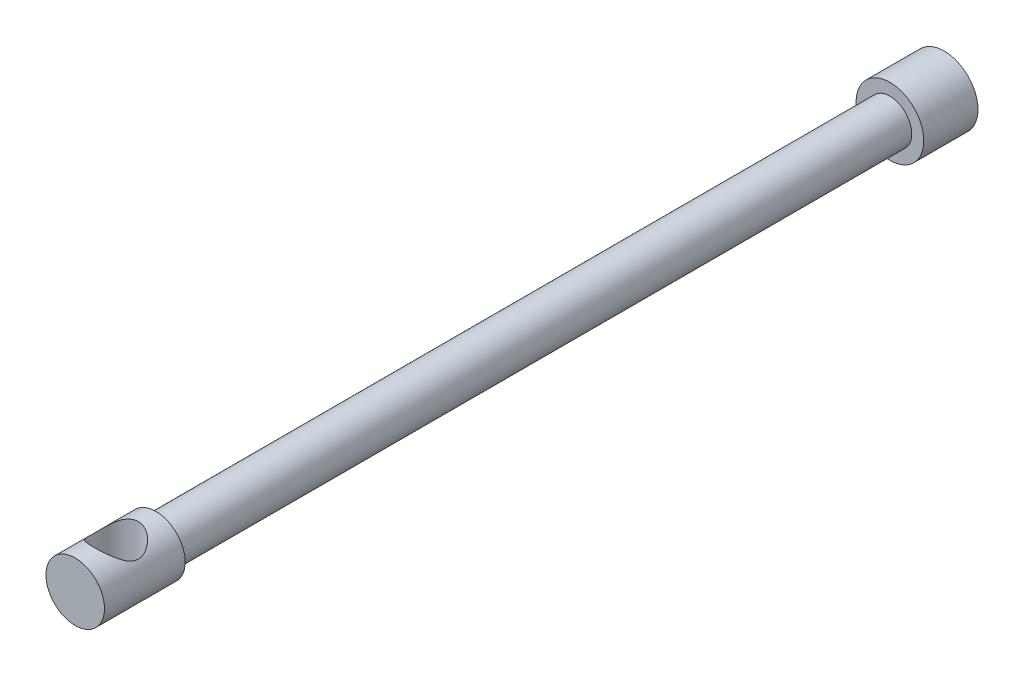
ISO-10303-21;
HEADER;
FILE_DESCRIPTION(('STEP AP214'),'2;1');
FILE_NAME('part.step','',(''),(''),'','','');
FILE_SCHEMA(('AUTOMOTIVE_DESIGN { 1 0 10303 214 1 1 1 1 }'));
ENDSEC;
DATA;
#1=APPLICATION_CONTEXT('core data for automotive mechanical design processes');
#2=APPLICATION_PROTOCOL_DEFINITION('international standard','automotive_design',2000,#1);
#3=PRODUCT_CONTEXT('',#1,'mechanical');
#4=PRODUCT('Part','Part','',(#3));
#5=PRODUCT_RELATED_PRODUCT_CATEGORY('part','',(#4));
#6=PRODUCT_DEFINITION_FORMATION('','',#4);
#7=PRODUCT_DEFINITION_CONTEXT('part definition',#1,'design');
#8=PRODUCT_DEFINITION('design','',#6,#7);
#9=PRODUCT_DEFINITION_SHAPE('','',#8);
#10=(LENGTH_UNIT() NAMED_UNIT(*) SI_UNIT(.MILLI.,.METRE.));
#11=(NAMED_UNIT(*) PLANE_ANGLE_UNIT() SI_UNIT($,.RADIAN.));
#12=(NAMED_UNIT(*) SI_UNIT($,.STERADIAN.) SOLID_ANGLE_UNIT());
#13=UNCERTAINTY_MEASURE_WITH_UNIT(LENGTH_MEASURE(1.E-05),#10,'distance_accuracy_value','');
#14=(GEOMETRIC_REPRESENTATION_CONTEXT(3) GLOBAL_UNCERTAINTY_ASSIGNED_CONTEXT((#13)) GLOBAL_UNIT_ASSIGNED_CONTEXT((#10,
#11,#12)) REPRESENTATION_CONTEXT('',''));
#15=CARTESIAN_POINT('',(0.,0.,0.));
#16=DIRECTION('',(0.,0.,1.));
#17=DIRECTION('',(1.,0.,0.));
#18=AXIS2_PLACEMENT_3D('',#15,#16,#17);
#19=CARTESIAN_POINT('',(0.,0.,5.842));
#20=DIRECTION('',(0.,0.,1.));
#21=DIRECTION('',(1.,0.,0.));
#22=AXIS2_PLACEMENT_3D('',#19,#20,#21);
#23=PLANE('',#22);
#24=CARTESIAN_POINT('',(0.,0.,5.842));
#25=DIRECTION('',(0.,0.,1.));
#26=DIRECTION('',(1.,0.,0.));
#27=AXIS2_PLACEMENT_3D('',#24,#25,#26);
#28=CIRCLE('',#27,3.63855);
#29=CARTESIAN_POINT('',(3.63855,0.,5.842));
#30=VERTEX_POINT('',#29);
#31=EDGE_CURVE('E10',#30,#30,#28,.T.);
#32=ORIENTED_EDGE('',*,*,#31,.T.);
#33=EDGE_LOOP('',(#32));
#34=FACE_BOUND('',#33,.T.);
#35=CARTESIAN_POINT('',(0.,0.,5.842));
#36=DIRECTION('',(0.,0.,1.));
#37=DIRECTION('',(1.,0.,0.));
#38=AXIS2_PLACEMENT_3D('',#35,#36,#37);
#39=CIRCLE('',#38,2.3495);
#40=CARTESIAN_POINT('',(-2.3495,0.,5.84199999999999));
#41=VERTEX_POINT('',#40);
#42=EDGE_CURVE('E47',#41,#41,#39,.F.);
#43=ORIENTED_EDGE('',*,*,#42,.T.);
#44=EDGE_LOOP('',(#43));
#45=FACE_BOUND('',#44,.T.);
#46=ADVANCED_FACE('F30',(#34,#45),#23,.T.);
#47=CARTESIAN_POINT('',(0.,0.,5.842));
#48=DIRECTION('',(0.,0.,-1.));
#49=DIRECTION('',(-1.,0.,0.));
#50=AXIS2_PLACEMENT_3D('',#47,#48,#49);
#51=CYLINDRICAL_SURFACE('',#50,3.63855);
#52=ORIENTED_EDGE('',*,*,#31,.F.);
#53=EDGE_LOOP('',(#52));
#54=FACE_BOUND('',#53,.T.);
#55=CARTESIAN_POINT('',(0.,0.,0.));
#56=DIRECTION('',(0.,0.,1.));
#57=DIRECTION('',(1.,0.,0.));
#58=AXIS2_PLACEMENT_3D('',#55,#56,#57);
#59=CIRCLE('',#58,3.63855);
#60=CARTESIAN_POINT('',(3.63855,0.,0.));
#61=VERTEX_POINT('',#60);
#62=EDGE_CURVE('E42',#61,#61,#59,.T.);
#63=ORIENTED_EDGE('',*,*,#62,.T.);
#64=EDGE_LOOP('',(#63));
#65=FACE_BOUND('',#64,.T.);
#66=ADVANCED_FACE('F32',(#54,#65),#51,.T.);
#67=CARTESIAN_POINT('',(0.,0.,0.));
#68=DIRECTION('',(0.,0.,1.));
#69=DIRECTION('',(1.,0.,0.));
#70=AXIS2_PLACEMENT_3D('',#67,#68,#69);
#71=PLANE('',#70);
#72=ORIENTED_EDGE('',*,*,#62,.F.);
#73=EDGE_LOOP('',(#72));
#74=FACE_BOUND('',#73,.T.);
#75=ADVANCED_FACE('F80',(#74),#71,.F.);
#76=CARTESIAN_POINT('',(0.,0.,84.8614));
#77=DIRECTION('',(0.,0.,-1.));
#78=DIRECTION('',(-1.,0.,0.));
#79=AXIS2_PLACEMENT_3D('',#76,#77,#78);
#80=CYLINDRICAL_SURFACE('',#79,2.3495);
#81=CARTESIAN_POINT('',(0.,0.,84.8614));
#82=DIRECTION('',(0.,0.,1.));
#83=DIRECTION('',(1.,0.,0.));
#84=AXIS2_PLACEMENT_3D('',#81,#82,#83);
#85=CIRCLE('',#84,2.3495);
#86=CARTESIAN_POINT('',(-2.3495,0.,84.8614));
#87=VERTEX_POINT('',#86);
#88=EDGE_CURVE('E95',#87,#87,#85,.T.);
#89=CARTESIAN_POINT('',(-2.3495,0.,5.84199999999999));
#90=CARTESIAN_POINT('',(-2.3495,0.,6.66511874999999));
#91=CARTESIAN_POINT('',(-2.3495,0.,7.48823749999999));
#92=CARTESIAN_POINT('',(-2.3495,0.,9.13447499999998));
#93=CARTESIAN_POINT('',(-2.3495,0.,9.95759374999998));
#94=CARTESIAN_POINT('',(-2.3495,0.,11.60383125));
#95=CARTESIAN_POINT('',(-2.3495,0.,12.42695));
#96=CARTESIAN_POINT('',(-2.3495,0.,14.0731875));
#97=CARTESIAN_POINT('',(-2.3495,0.,14.89630625));
#98=CARTESIAN_POINT('',(-2.3495,0.,16.54254375));
#99=CARTESIAN_POINT('',(-2.3495,0.,17.3656625));
#100=CARTESIAN_POINT('',(-2.3495,0.,19.0119));
#101=CARTESIAN_POINT('',(-2.3495,0.,19.83501875));
#102=CARTESIAN_POINT('',(-2.3495,0.,21.48125625));
#103=CARTESIAN_POINT('',(-2.3495,0.,22.304375));
#104=CARTESIAN_POINT('',(-2.3495,0.,23.9506125));
#105=CARTESIAN_POINT('',(-2.3495,0.,24.77373125));
#106=CARTESIAN_POINT('',(-2.3495,0.,26.41996875));
#107=CARTESIAN_POINT('',(-2.3495,0.,27.2430875));
#108=CARTESIAN_POINT('',(-2.3495,0.,28.889325));
#109=CARTESIAN_POINT('',(-2.3495,0.,29.71244375));
#110=CARTESIAN_POINT('',(-2.3495,0.,31.35868125));
#111=CARTESIAN_POINT('',(-2.3495,0.,32.1818));
#112=CARTESIAN_POINT('',(-2.3495,0.,33.8280375));
#113=CARTESIAN_POINT('',(-2.3495,0.,34.65115625));
#114=CARTESIAN_POINT('',(-2.3495,0.,36.29739375));
#115=CARTESIAN_POINT('',(-2.3495,0.,37.1205125));
#116=CARTESIAN_POINT('',(-2.3495,0.,38.76675));
#117=CARTESIAN_POINT('',(-2.3495,0.,39.58986875));
#118=CARTESIAN_POINT('',(-2.3495,0.,41.23610625));
#119=CARTESIAN_POINT('',(-2.3495,0.,42.059225));
#120=CARTESIAN_POINT('',(-2.3495,0.,43.7054625));
#121=CARTESIAN_POINT('',(-2.3495,0.,44.52858125));
#122=CARTESIAN_POINT('',(-2.3495,0.,46.17481875));
#123=CARTESIAN_POINT('',(-2.3495,0.,46.9979375));
#124=CARTESIAN_POINT('',(-2.3495,0.,48.644175));
#125=CARTESIAN_POINT('',(-2.3495,0.,49.46729375));
#126=CARTESIAN_POINT('',(-2.3495,0.,51.11353125));
#127=CARTESIAN_POINT('',(-2.3495,0.,51.93665));
#128=CARTESIAN_POINT('',(-2.3495,0.,53.5828875));
#129=CARTESIAN_POINT('',(-2.3495,0.,54.40600625));
#130=CARTESIAN_POINT('',(-2.3495,0.,56.05224375));
#131=CARTESIAN_POINT('',(-2.3495,0.,56.8753625));
#132=CARTESIAN_POINT('',(-2.3495,0.,58.5216));
#133=CARTESIAN_POINT('',(-2.3495,0.,59.34471875));
#134=CARTESIAN_POINT('',(-2.3495,0.,60.99095625));
#135=CARTESIAN_POINT('',(-2.3495,0.,61.814075));
#136=CARTESIAN_POINT('',(-2.3495,0.,63.4603125));
#137=CARTESIAN_POINT('',(-2.3495,0.,64.28343125));
#138=CARTESIAN_POINT('',(-2.3495,0.,65.92966875));
#139=CARTESIAN_POINT('',(-2.3495,0.,66.7527875));
#140=CARTESIAN_POINT('',(-2.3495,0.,68.399025));
#141=CARTESIAN_POINT('',(-2.3495,0.,69.22214375));
#142=CARTESIAN_POINT('',(-2.3495,0.,70.86838125));
#143=CARTESIAN_POINT('',(-2.3495,0.,71.6915));
#144=CARTESIAN_POINT('',(-2.3495,0.,73.3377375));
#145=CARTESIAN_POINT('',(-2.3495,0.,74.16085625));
#146=CARTESIAN_POINT('',(-2.3495,0.,75.80709375));
#147=CARTESIAN_POINT('',(-2.3495,0.,76.6302125));
#148=CARTESIAN_POINT('',(-2.3495,0.,78.27645));
#149=CARTESIAN_POINT('',(-2.3495,0.,79.09956875));
#150=CARTESIAN_POINT('',(-2.3495,0.,80.74580625));
#151=CARTESIAN_POINT('',(-2.3495,0.,81.568925));
#152=CARTESIAN_POINT('',(-2.3495,0.,83.2151625));
#153=CARTESIAN_POINT('',(-2.3495,0.,84.03828125));
#154=CARTESIAN_POINT('',(-2.3495,0.,84.8614));
#155=B_SPLINE_CURVE_WITH_KNOTS('',3,(#89,#90,#91,#92,#93,#94,#95,#96,#97,#98,#99,#100,#101,#102,
#103,#104,#105,#106,#107,#108,#109,#110,#111,#112,#113,#114,#115,#116,#117,#118,#119,#120,#121,
#122,#123,#124,#125,#126,#127,#128,#129,#130,#131,#132,#133,#134,#135,#136,#137,#138,#139,#140,
#141,#142,#143,#144,#145,#146,#147,#148,#149,#150,#151,#152,#153,#154),.UNSPECIFIED.,.F.,.F.,(4,
2,2,2,2,2,2,2,2,2,2,2,2,2,2,2,2,2,2,2,2,2,2,2,2,2,2,2,2,2,2,2,4),(0.,2.46935625,4.9387125,
7.40806875,9.877425,12.34678125,14.8161375,17.28549375,19.75485,22.22420625,24.6935625,
27.16291875,29.632275,32.10163125,34.5709875,37.04034375,39.5097,41.97905625,44.4484125,
46.91776875,49.387125,51.85648125,54.3258375,56.79519375,59.26455,61.73390625,64.2032625,
66.67261875,69.141975,71.61133125,74.0806875,76.55004375,79.0194),.UNSPECIFIED.);
#156=EDGE_CURVE('BSEAM67',#41,#87,#155,.T.);
#157=ORIENTED_EDGE('',*,*,#42,.F.);
#158=ORIENTED_EDGE('',*,*,#88,.F.);
#159=ORIENTED_EDGE('',*,*,#156,.T.);
#160=ORIENTED_EDGE('',*,*,#156,.F.);
#161=EDGE_LOOP('',(#157,#159,#158,#160));
#162=FACE_BOUND('',#161,.T.);
#163=ADVANCED_FACE('F67',(#162),#80,.T.);
#164=CARTESIAN_POINT('',(0.,0.,84.8614));
#165=DIRECTION('',(0.,0.,1.));
#166=DIRECTION('',(1.,0.,0.));
#167=AXIS2_PLACEMENT_3D('',#164,#165,#166);
#168=PLANE('',#167);
#169=CARTESIAN_POINT('',(0.,0.,84.8614));
#170=DIRECTION('',(0.,0.,1.));
#171=DIRECTION('',(1.,0.,0.));
#172=AXIS2_PLACEMENT_3D('',#169,#170,#171);
#173=CIRCLE('',#172,3.1496);
#174=CARTESIAN_POINT('',(3.1496,0.,84.8614));
#175=VERTEX_POINT('',#174);
#176=EDGE_CURVE('E99',#175,#175,#173,.T.);
#177=ORIENTED_EDGE('',*,*,#176,.F.);
#178=EDGE_LOOP('',(#177));
#179=FACE_BOUND('',#178,.T.);
#180=ORIENTED_EDGE('',*,*,#88,.T.);
#181=EDGE_LOOP('',(#180));
#182=FACE_BOUND('',#181,.T.);
#183=ADVANCED_FACE('F64',(#179,#182),#168,.F.);
#184=CARTESIAN_POINT('',(0.,0.,93.5482));
#185=DIRECTION('',(0.,0.,-1.));
#186=DIRECTION('',(-1.,0.,0.));
#187=AXIS2_PLACEMENT_3D('',#184,#185,#186);
#188=CYLINDRICAL_SURFACE('',#187,3.1496);
#189=CARTESIAN_POINT('',(0.,-3.1496,91.5543));
#190=CARTESIAN_POINT('',(0.116753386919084,-3.14959081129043,91.5542904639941));
#191=CARTESIAN_POINT('',(0.233649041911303,-3.14304210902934,91.5457147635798));
#192=CARTESIAN_POINT('',(0.463709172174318,-3.11743809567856,91.5119643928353));
#193=CARTESIAN_POINT('',(0.576865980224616,-3.09835857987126,91.4867575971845));
#194=CARTESIAN_POINT('',(0.79554628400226,-3.04951955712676,91.4214864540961));
#195=CARTESIAN_POINT('',(0.901110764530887,-3.0198235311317,91.3815103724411));
#196=CARTESIAN_POINT('',(1.10331111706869,-2.9519612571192,91.2886053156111));
#197=CARTESIAN_POINT('',(1.19994820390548,-2.91379616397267,91.235678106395));
#198=CARTESIAN_POINT('',(1.39183412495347,-2.82751662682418,91.1131793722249));
#199=CARTESIAN_POINT('',(1.4861119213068,-2.77880608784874,91.0425155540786));
#200=CARTESIAN_POINT('',(1.6622468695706,-2.6771775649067,90.8895149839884));
#201=CARTESIAN_POINT('',(1.74408527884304,-2.62425341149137,90.8071609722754));
#202=CARTESIAN_POINT('',(1.91071251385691,-2.50631564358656,90.6135250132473));
#203=CARTESIAN_POINT('',(1.99252333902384,-2.44109349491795,90.4997979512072));
#204=CARTESIAN_POINT('',(2.13623724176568,-2.31634876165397,90.2575073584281));
#205=CARTESIAN_POINT('',(2.19816512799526,-2.25681913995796,90.1289625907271));
#206=CARTESIAN_POINT('',(2.28171742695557,-2.17163210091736,89.9050222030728));
#207=CARTESIAN_POINT('',(2.30985946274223,-2.14141794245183,89.8138157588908));
#208=CARTESIAN_POINT('',(2.35538232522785,-2.09124548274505,89.626120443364));
#209=CARTESIAN_POINT('',(2.37278826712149,-2.07126326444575,89.5296444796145));
#210=CARTESIAN_POINT('',(2.39573683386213,-2.04469222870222,89.3323673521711));
#211=CARTESIAN_POINT('',(2.40115952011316,-2.03823885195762,89.2315326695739));
#212=CARTESIAN_POINT('',(2.3992169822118,-2.0405239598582,89.0301445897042));
#213=CARTESIAN_POINT('',(2.39184927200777,-2.04926539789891,88.9295912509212));
#214=CARTESIAN_POINT('',(2.36666505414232,-2.0782612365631,88.7440345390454));
#215=CARTESIAN_POINT('',(2.35018575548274,-2.09703353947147,88.6585974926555));
#216=CARTESIAN_POINT('',(2.30880032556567,-2.14251470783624,88.4919876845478));
#217=CARTESIAN_POINT('',(2.28388546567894,-2.16923179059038,88.4108194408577));
#218=CARTESIAN_POINT('',(2.20797394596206,-2.24707717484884,88.2025115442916));
#219=CARTESIAN_POINT('',(2.15051705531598,-2.30284017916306,88.0794623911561));
#220=CARTESIAN_POINT('',(2.01746799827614,-2.42027547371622,87.8465927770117));
#221=CARTESIAN_POINT('',(1.9418303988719,-2.48196233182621,87.7368065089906));
#222=CARTESIAN_POINT('',(1.77089813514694,-2.60680744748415,87.5279351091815));
#223=CARTESIAN_POINT('',(1.6750861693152,-2.66995496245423,87.4292648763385));
#224=CARTESIAN_POINT('',(1.46595637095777,-2.79024398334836,87.2483615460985));
#225=CARTESIAN_POINT('',(1.3526712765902,-2.84739639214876,87.1660983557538));
#226=CARTESIAN_POINT('',(1.13278231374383,-2.94078675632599,87.0347121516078));
#227=CARTESIAN_POINT('',(1.02898728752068,-2.97893550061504,86.9822627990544));
#228=CARTESIAN_POINT('',(0.812104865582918,-3.04520762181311,86.892212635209));
#229=CARTESIAN_POINT('',(0.69902298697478,-3.07333689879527,86.8546030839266));
#230=CARTESIAN_POINT('',(0.465391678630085,-3.11730600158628,86.7961553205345));
#231=CARTESIAN_POINT('',(0.344797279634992,-3.13306219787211,86.775431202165));
#232=CARTESIAN_POINT('',(0.100858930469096,-3.15035337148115,86.7526994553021));
#233=CARTESIAN_POINT('',(-0.0224834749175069,-3.15189614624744,86.7506815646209));
#234=CARTESIAN_POINT('',(-0.25378158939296,-3.14125667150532,86.7646559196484));
#235=CARTESIAN_POINT('',(-0.361934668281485,-3.13056860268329,86.7786874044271));
#236=CARTESIAN_POINT('',(-0.573852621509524,-3.09873495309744,86.8208030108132));
#237=CARTESIAN_POINT('',(-0.677616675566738,-3.07758742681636,86.8488897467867));
#238=CARTESIAN_POINT('',(-0.880898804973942,-3.02576878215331,86.9185379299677));
#239=CARTESIAN_POINT('',(-0.980253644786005,-2.99487983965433,86.9604086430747));
#240=CARTESIAN_POINT('',(-1.17044099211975,-2.92579860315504,87.0557068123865));
#241=CARTESIAN_POINT('',(-1.26127218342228,-2.88760518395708,87.1091360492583));
#242=CARTESIAN_POINT('',(-1.44771669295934,-2.79935733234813,87.2356036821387));
#243=CARTESIAN_POINT('',(-1.54168278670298,-2.74838464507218,87.3104199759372));
#244=CARTESIAN_POINT('',(-1.71658309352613,-2.64268427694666,87.4720355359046));
#245=CARTESIAN_POINT('',(-1.79749107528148,-2.58794934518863,87.5588582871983));
#246=CARTESIAN_POINT('',(-1.91606853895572,-2.5003453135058,87.7065314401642));
#247=CARTESIAN_POINT('',(-1.95810722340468,-2.46746798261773,87.7639178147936));
#248=CARTESIAN_POINT('',(-2.03714211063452,-2.40263503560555,87.8825519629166));
#249=CARTESIAN_POINT('',(-2.07413652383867,-2.37067974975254,87.9438010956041));
#250=CARTESIAN_POINT('',(-2.17711958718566,-2.27784489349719,88.1331234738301));
#251=CARTESIAN_POINT('',(-2.23539805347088,-2.21977096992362,88.2671298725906));
#252=CARTESIAN_POINT('',(-2.31006415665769,-2.1413404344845,88.4956266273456));
#253=CARTESIAN_POINT('',(-2.33394940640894,-2.11505134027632,88.5856464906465));
#254=CARTESIAN_POINT('',(-2.37126859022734,-2.07312776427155,88.7701538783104));
#255=CARTESIAN_POINT('',(-2.38472767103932,-2.05746765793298,88.8646300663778));
#256=CARTESIAN_POINT('',(-2.40026378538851,-2.03933325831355,89.0565659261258));
#257=CARTESIAN_POINT('',(-2.40225441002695,-2.0369590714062,89.1540426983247));
#258=CARTESIAN_POINT('',(-2.39442674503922,-2.04614887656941,89.347891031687));
#259=CARTESIAN_POINT('',(-2.38459766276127,-2.05772560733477,89.4442615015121));
#260=CARTESIAN_POINT('',(-2.3516839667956,-2.09529291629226,89.6470689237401));
#261=CARTESIAN_POINT('',(-2.32683408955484,-2.12318306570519,89.7528510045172));
#262=CARTESIAN_POINT('',(-2.26447746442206,-2.18956301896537,89.9571542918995));
#263=CARTESIAN_POINT('',(-2.22693769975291,-2.22808042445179,90.0556557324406));
#264=CARTESIAN_POINT('',(-2.12343336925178,-2.32765655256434,90.282556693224));
#265=CARTESIAN_POINT('',(-2.05210269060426,-2.39158259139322,90.4072358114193));
#266=CARTESIAN_POINT('',(-1.88942507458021,-2.52210030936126,90.6412238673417));
#267=CARTESIAN_POINT('',(-1.79805433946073,-2.58869508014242,90.7505142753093));
#268=CARTESIAN_POINT('',(-1.59437325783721,-2.71897484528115,90.9541311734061));
#269=CARTESIAN_POINT('',(-1.48174765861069,-2.78259522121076,91.0481865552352));
#270=CARTESIAN_POINT('',(-1.23757845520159,-2.89941028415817,91.2159512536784));
#271=CARTESIAN_POINT('',(-1.10607875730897,-2.95262850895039,91.2897066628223));
#272=CARTESIAN_POINT('',(-0.865663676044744,-3.03016134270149,91.3954798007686));
#273=CARTESIAN_POINT('',(-0.760594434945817,-3.05839872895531,91.4333998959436));
#274=CARTESIAN_POINT('',(-0.544143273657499,-3.10419654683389,91.4944940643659));
#275=CARTESIAN_POINT('',(-0.432777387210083,-3.12178287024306,91.5177039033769));
#276=CARTESIAN_POINT('',(-0.267011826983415,-3.13871392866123,91.5400011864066));
#277=CARTESIAN_POINT('',(-0.213847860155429,-3.14278566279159,91.5453525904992));
#278=CARTESIAN_POINT('',(-0.107132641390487,-3.14823111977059,91.5525045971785));
#279=CARTESIAN_POINT('',(-0.0535813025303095,-3.14960421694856,91.5543043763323));
#280=CARTESIAN_POINT('',(0.,-3.1496,91.5543));
#281=B_SPLINE_CURVE_WITH_KNOTS('',3,(#189,#190,#191,#192,#193,#194,#195,#196,#197,#198,#199,
#200,#201,#202,#203,#204,#205,#206,#207,#208,#209,#210,#211,#212,#213,#214,#215,#216,#217,#218,
#219,#220,#221,#222,#223,#224,#225,#226,#227,#228,#229,#230,#231,#232,#233,#234,#235,#236,#237,
#238,#239,#240,#241,#242,#243,#244,#245,#246,#247,#248,#249,#250,#251,#252,#253,#254,#255,#256,
#257,#258,#259,#260,#261,#262,#263,#264,#265,#266,#267,#268,#269,#270,#271,#272,#273,#274,#275,
#276,#277,#278,#279,#280),.UNSPECIFIED.,.T.,.F.,(4,2,2,2,2,2,2,2,2,2,2,2,2,2,2,2,2,2,2,2,2,2,2,
2,2,2,2,2,2,2,2,2,2,2,2,2,2,2,2,2,2,2,2,2,2,4),(0.,0.350030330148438,0.700738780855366,
1.0493843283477,1.39798236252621,1.77910995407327,2.16080622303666,2.62251905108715,
3.08365352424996,3.38302933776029,3.68170213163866,3.98335100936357,4.28505852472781,
4.55112339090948,4.81746441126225,5.25547760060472,5.69459696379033,6.14676413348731,
6.59809417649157,6.96381209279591,7.32931429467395,7.69726615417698,8.06501614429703,
8.39222858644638,8.71950191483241,9.05468517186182,9.38992010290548,9.77997912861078,
10.1708122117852,10.405660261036,10.6405914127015,11.1089314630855,11.3982846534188,
11.6869377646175,11.9777629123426,12.2688538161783,12.6035543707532,12.9391325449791,
13.4083870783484,13.8782019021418,14.3556279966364,14.8319609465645,15.1762345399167,
15.51966784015,15.6802690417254,15.8409074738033),.UNSPECIFIED.);
#282=CARTESIAN_POINT('',(0.,-3.1496,91.5543));
#283=VERTEX_POINT('',#282);
#284=EDGE_CURVE('E34',#283,#283,#281,.T.);
#285=ORIENTED_EDGE('',*,*,#284,.T.);
#286=EDGE_LOOP('',(#285));
#287=FACE_BOUND('',#286,.T.);
#288=CARTESIAN_POINT('',(0.,3.1496,91.5543));
#289=CARTESIAN_POINT('',(-0.116753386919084,3.14959081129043,91.5542904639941));
#290=CARTESIAN_POINT('',(-0.233649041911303,3.14304210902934,91.5457147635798));
#291=CARTESIAN_POINT('',(-0.463709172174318,3.11743809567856,91.5119643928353));
#292=CARTESIAN_POINT('',(-0.576865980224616,3.09835857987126,91.4867575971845));
#293=CARTESIAN_POINT('',(-0.79554628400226,3.04951955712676,91.4214864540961));
#294=CARTESIAN_POINT('',(-0.901110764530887,3.0198235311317,91.3815103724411));
#295=CARTESIAN_POINT('',(-1.10331111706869,2.9519612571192,91.2886053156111));
#296=CARTESIAN_POINT('',(-1.19994820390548,2.91379616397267,91.235678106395));
#297=CARTESIAN_POINT('',(-1.39183412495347,2.82751662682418,91.1131793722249));
#298=CARTESIAN_POINT('',(-1.4861119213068,2.77880608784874,91.0425155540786));
#299=CARTESIAN_POINT('',(-1.6622468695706,2.6771775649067,90.8895149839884));
#300=CARTESIAN_POINT('',(-1.74408527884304,2.62425341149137,90.8071609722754));
#301=CARTESIAN_POINT('',(-1.91071251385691,2.50631564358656,90.6135250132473));
#302=CARTESIAN_POINT('',(-1.99252333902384,2.44109349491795,90.4997979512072));
#303=CARTESIAN_POINT('',(-2.13623724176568,2.31634876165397,90.2575073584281));
#304=CARTESIAN_POINT('',(-2.19816512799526,2.25681913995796,90.1289625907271));
#305=CARTESIAN_POINT('',(-2.28171742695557,2.17163210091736,89.9050222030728));
#306=CARTESIAN_POINT('',(-2.30985946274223,2.14141794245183,89.8138157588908));
#307=CARTESIAN_POINT('',(-2.35538232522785,2.09124548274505,89.626120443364));
#308=CARTESIAN_POINT('',(-2.37278826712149,2.07126326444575,89.5296444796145));
#309=CARTESIAN_POINT('',(-2.39573683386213,2.04469222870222,89.3323673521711));
#310=CARTESIAN_POINT('',(-2.40115952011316,2.03823885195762,89.2315326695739));
#311=CARTESIAN_POINT('',(-2.3992169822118,2.0405239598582,89.0301445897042));
#312=CARTESIAN_POINT('',(-2.39184927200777,2.04926539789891,88.9295912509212));
#313=CARTESIAN_POINT('',(-2.36666505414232,2.0782612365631,88.7440345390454));
#314=CARTESIAN_POINT('',(-2.35018575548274,2.09703353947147,88.6585974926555));
#315=CARTESIAN_POINT('',(-2.30880032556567,2.14251470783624,88.4919876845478));
#316=CARTESIAN_POINT('',(-2.28388546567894,2.16923179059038,88.4108194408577));
#317=CARTESIAN_POINT('',(-2.20797394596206,2.24707717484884,88.2025115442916));
#318=CARTESIAN_POINT('',(-2.15051705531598,2.30284017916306,88.0794623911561));
#319=CARTESIAN_POINT('',(-2.01746799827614,2.42027547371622,87.8465927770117));
#320=CARTESIAN_POINT('',(-1.9418303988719,2.48196233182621,87.7368065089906));
#321=CARTESIAN_POINT('',(-1.77089813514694,2.60680744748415,87.5279351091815));
#322=CARTESIAN_POINT('',(-1.6750861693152,2.66995496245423,87.4292648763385));
#323=CARTESIAN_POINT('',(-1.46595637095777,2.79024398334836,87.2483615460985));
#324=CARTESIAN_POINT('',(-1.3526712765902,2.84739639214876,87.1660983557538));
#325=CARTESIAN_POINT('',(-1.13278231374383,2.94078675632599,87.0347121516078));
#326=CARTESIAN_POINT('',(-1.02898728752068,2.97893550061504,86.9822627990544));
#327=CARTESIAN_POINT('',(-0.812104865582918,3.04520762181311,86.892212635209));
#328=CARTESIAN_POINT('',(-0.69902298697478,3.07333689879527,86.8546030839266));
#329=CARTESIAN_POINT('',(-0.465391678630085,3.11730600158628,86.7961553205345));
#330=CARTESIAN_POINT('',(-0.344797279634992,3.13306219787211,86.775431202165));
#331=CARTESIAN_POINT('',(-0.100858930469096,3.15035337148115,86.7526994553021));
#332=CARTESIAN_POINT('',(0.0224834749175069,3.15189614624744,86.7506815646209));
#333=CARTESIAN_POINT('',(0.25378158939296,3.14125667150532,86.7646559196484));
#334=CARTESIAN_POINT('',(0.361934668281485,3.13056860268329,86.7786874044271));
#335=CARTESIAN_POINT('',(0.573852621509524,3.09873495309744,86.8208030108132));
#336=CARTESIAN_POINT('',(0.677616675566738,3.07758742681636,86.8488897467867));
#337=CARTESIAN_POINT('',(0.880898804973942,3.02576878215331,86.9185379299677));
#338=CARTESIAN_POINT('',(0.980253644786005,2.99487983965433,86.9604086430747));
#339=CARTESIAN_POINT('',(1.17044099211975,2.92579860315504,87.0557068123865));
#340=CARTESIAN_POINT('',(1.26127218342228,2.88760518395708,87.1091360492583));
#341=CARTESIAN_POINT('',(1.44771669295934,2.79935733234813,87.2356036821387));
#342=CARTESIAN_POINT('',(1.54168278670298,2.74838464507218,87.3104199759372));
#343=CARTESIAN_POINT('',(1.71658309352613,2.64268427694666,87.4720355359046));
#344=CARTESIAN_POINT('',(1.79749107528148,2.58794934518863,87.5588582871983));
#345=CARTESIAN_POINT('',(1.91606853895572,2.5003453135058,87.7065314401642));
#346=CARTESIAN_POINT('',(1.95810722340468,2.46746798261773,87.7639178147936));
#347=CARTESIAN_POINT('',(2.03714211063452,2.40263503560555,87.8825519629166));
#348=CARTESIAN_POINT('',(2.07413652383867,2.37067974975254,87.9438010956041));
#349=CARTESIAN_POINT('',(2.17711958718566,2.27784489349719,88.1331234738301));
#350=CARTESIAN_POINT('',(2.23539805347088,2.21977096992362,88.2671298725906));
#351=CARTESIAN_POINT('',(2.31006415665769,2.1413404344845,88.4956266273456));
#352=CARTESIAN_POINT('',(2.33394940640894,2.11505134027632,88.5856464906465));
#353=CARTESIAN_POINT('',(2.37126859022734,2.07312776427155,88.7701538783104));
#354=CARTESIAN_POINT('',(2.38472767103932,2.05746765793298,88.8646300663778));
#355=CARTESIAN_POINT('',(2.40026378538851,2.03933325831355,89.0565659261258));
#356=CARTESIAN_POINT('',(2.40225441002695,2.0369590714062,89.1540426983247));
#357=CARTESIAN_POINT('',(2.39442674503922,2.04614887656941,89.347891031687));
#358=CARTESIAN_POINT('',(2.38459766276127,2.05772560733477,89.4442615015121));
#359=CARTESIAN_POINT('',(2.3516839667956,2.09529291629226,89.6470689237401));
#360=CARTESIAN_POINT('',(2.32683408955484,2.12318306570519,89.7528510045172));
#361=CARTESIAN_POINT('',(2.26447746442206,2.18956301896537,89.9571542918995));
#362=CARTESIAN_POINT('',(2.22693769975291,2.22808042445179,90.0556557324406));
#363=CARTESIAN_POINT('',(2.12343336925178,2.32765655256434,90.282556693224));
#364=CARTESIAN_POINT('',(2.05210269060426,2.39158259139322,90.4072358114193));
#365=CARTESIAN_POINT('',(1.88942507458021,2.52210030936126,90.6412238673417));
#366=CARTESIAN_POINT('',(1.79805433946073,2.58869508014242,90.7505142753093));
#367=CARTESIAN_POINT('',(1.59437325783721,2.71897484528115,90.9541311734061));
#368=CARTESIAN_POINT('',(1.48174765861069,2.78259522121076,91.0481865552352));
#369=CARTESIAN_POINT('',(1.23757845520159,2.89941028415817,91.2159512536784));
#370=CARTESIAN_POINT('',(1.10607875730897,2.95262850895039,91.2897066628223));
#371=CARTESIAN_POINT('',(0.865663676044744,3.03016134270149,91.3954798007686));
#372=CARTESIAN_POINT('',(0.760594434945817,3.05839872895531,91.4333998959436));
#373=CARTESIAN_POINT('',(0.544143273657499,3.10419654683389,91.4944940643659));
#374=CARTESIAN_POINT('',(0.432777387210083,3.12178287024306,91.5177039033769));
#375=CARTESIAN_POINT('',(0.267011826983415,3.13871392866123,91.5400011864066));
#376=CARTESIAN_POINT('',(0.213847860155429,3.14278566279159,91.5453525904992));
#377=CARTESIAN_POINT('',(0.107132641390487,3.14823111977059,91.5525045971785));
#378=CARTESIAN_POINT('',(0.0535813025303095,3.14960421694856,91.5543043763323));
#379=CARTESIAN_POINT('',(0.,3.1496,91.5543));
#380=B_SPLINE_CURVE_WITH_KNOTS('',3,(#288,#289,#290,#291,#292,#293,#294,#295,#296,#297,#298,
#299,#300,#301,#302,#303,#304,#305,#306,#307,#308,#309,#310,#311,#312,#313,#314,#315,#316,#317,
#318,#319,#320,#321,#322,#323,#324,#325,#326,#327,#328,#329,#330,#331,#332,#333,#334,#335,#336,
#337,#338,#339,#340,#341,#342,#343,#344,#345,#346,#347,#348,#349,#350,#351,#352,#353,#354,#355,
#356,#357,#358,#359,#360,#361,#362,#363,#364,#365,#366,#367,#368,#369,#370,#371,#372,#373,#374,
#375,#376,#377,#378,#379),.UNSPECIFIED.,.T.,.F.,(4,2,2,2,2,2,2,2,2,2,2,2,2,2,2,2,2,2,2,2,2,2,2,
2,2,2,2,2,2,2,2,2,2,2,2,2,2,2,2,2,2,2,2,2,2,4),(0.,0.350030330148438,0.700738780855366,
1.0493843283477,1.39798236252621,1.77910995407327,2.16080622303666,2.62251905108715,
3.08365352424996,3.38302933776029,3.68170213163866,3.98335100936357,4.28505852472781,
4.55112339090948,4.81746441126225,5.25547760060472,5.69459696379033,6.14676413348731,
6.59809417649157,6.96381209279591,7.32931429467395,7.69726615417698,8.06501614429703,
8.39222858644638,8.71950191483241,9.05468517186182,9.38992010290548,9.77997912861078,
10.1708122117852,10.405660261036,10.6405914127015,11.1089314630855,11.3982846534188,
11.6869377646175,11.9777629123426,12.2688538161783,12.6035543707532,12.9391325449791,
13.4083870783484,13.8782019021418,14.3556279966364,14.8319609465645,15.1762345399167,
15.51966784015,15.6802690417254,15.8409074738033),.UNSPECIFIED.);
#381=CARTESIAN_POINT('',(0.,3.1496,91.5543));
#382=VERTEX_POINT('',#381);
#383=EDGE_CURVE('E50',#382,#382,#380,.T.);
#384=ORIENTED_EDGE('',*,*,#383,.T.);
#385=EDGE_LOOP('',(#384));
#386=FACE_BOUND('',#385,.T.);
#387=CARTESIAN_POINT('',(0.,0.,93.5482));
#388=DIRECTION('',(0.,0.,1.));
#389=DIRECTION('',(1.,0.,0.));
#390=AXIS2_PLACEMENT_3D('',#387,#388,#389);
#391=CIRCLE('',#390,3.1496);
#392=CARTESIAN_POINT('',(3.1496,0.,93.5482));
#393=VERTEX_POINT('',#392);
#394=EDGE_CURVE('E97',#393,#393,#391,.T.);
#395=ORIENTED_EDGE('',*,*,#394,.F.);
#396=EDGE_LOOP('',(#395));
#397=FACE_BOUND('',#396,.T.);
#398=ORIENTED_EDGE('',*,*,#176,.T.);
#399=EDGE_LOOP('',(#398));
#400=FACE_BOUND('',#399,.T.);
#401=ADVANCED_FACE('F54',(#287,#386,#397,#400),#188,.T.);
#402=CARTESIAN_POINT('',(0.,0.,93.5482));
#403=DIRECTION('',(0.,0.,1.));
#404=DIRECTION('',(1.,0.,0.));
#405=AXIS2_PLACEMENT_3D('',#402,#403,#404);
#406=PLANE('',#405);
#407=ORIENTED_EDGE('',*,*,#394,.T.);
#408=EDGE_LOOP('',(#407));
#409=FACE_BOUND('',#408,.T.);
#410=ADVANCED_FACE('F62',(#409),#406,.T.);
#411=CARTESIAN_POINT('',(0.,-3.63855,89.154));
#412=DIRECTION('',(0.,1.,0.));
#413=DIRECTION('',(0.,0.,1.));
#414=AXIS2_PLACEMENT_3D('',#411,#412,#413);
#415=CYLINDRICAL_SURFACE('',#414,2.4003);
#416=ORIENTED_EDGE('',*,*,#383,.F.);
#417=EDGE_LOOP('',(#416));
#418=FACE_BOUND('',#417,.T.);
#419=ORIENTED_EDGE('',*,*,#284,.F.);
#420=EDGE_LOOP('',(#419));
#421=FACE_BOUND('',#420,.T.);
#422=ADVANCED_FACE('F58',(#418,#421),#415,.F.);
#423=CLOSED_SHELL('',(#46,#66,#75,#163,#183,#401,#410,#422));
#424=MANIFOLD_SOLID_BREP('B2',#423);
#425=ADVANCED_BREP_SHAPE_REPRESENTATION('',(#18,#424),#14);
#426=SHAPE_DEFINITION_REPRESENTATION(#9,#425);
ENDSEC;
END-ISO-10303-21;
